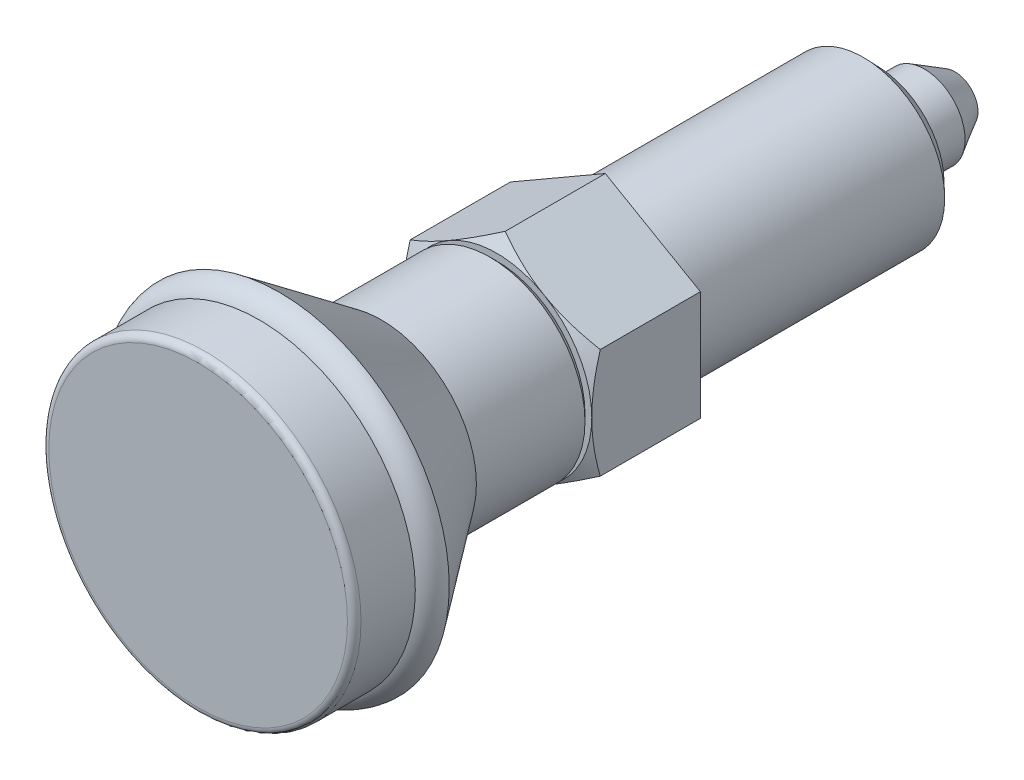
ISO-10303-21;
HEADER;
FILE_DESCRIPTION(('STEP AP214'),'2;1');
FILE_NAME('part.step','',(''),(''),'','','');
FILE_SCHEMA(('AUTOMOTIVE_DESIGN { 1 0 10303 214 1 1 1 1 }'));
ENDSEC;
DATA;
#1=APPLICATION_CONTEXT('core data for automotive mechanical design processes');
#2=APPLICATION_PROTOCOL_DEFINITION('international standard','automotive_design',2000,#1);
#3=PRODUCT_CONTEXT('',#1,'mechanical');
#4=PRODUCT('Part','Part','',(#3));
#5=PRODUCT_RELATED_PRODUCT_CATEGORY('part','',(#4));
#6=PRODUCT_DEFINITION_FORMATION('','',#4);
#7=PRODUCT_DEFINITION_CONTEXT('part definition',#1,'design');
#8=PRODUCT_DEFINITION('design','',#6,#7);
#9=PRODUCT_DEFINITION_SHAPE('','',#8);
#10=(LENGTH_UNIT() NAMED_UNIT(*) SI_UNIT(.MILLI.,.METRE.));
#11=(NAMED_UNIT(*) PLANE_ANGLE_UNIT() SI_UNIT($,.RADIAN.));
#12=(NAMED_UNIT(*) SI_UNIT($,.STERADIAN.) SOLID_ANGLE_UNIT());
#13=UNCERTAINTY_MEASURE_WITH_UNIT(LENGTH_MEASURE(1.E-05),#10,'distance_accuracy_value','');
#14=(GEOMETRIC_REPRESENTATION_CONTEXT(3) GLOBAL_UNCERTAINTY_ASSIGNED_CONTEXT((#13)) GLOBAL_UNIT_ASSIGNED_CONTEXT((#10,
#11,#12)) REPRESENTATION_CONTEXT('',''));
#15=CARTESIAN_POINT('',(0.,0.,0.));
#16=DIRECTION('',(0.,0.,1.));
#17=DIRECTION('',(1.,0.,0.));
#18=AXIS2_PLACEMENT_3D('',#15,#16,#17);
#19=CARTESIAN_POINT('',(1.25822981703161E-10,-7.26417500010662E-11,7.99999999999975));
#20=DIRECTION('',(-1.57278727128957E-11,9.08021875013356E-12,-1.));
#21=DIRECTION('',(-1.,0.,1.57278727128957E-11));
#22=AXIS2_PLACEMENT_3D('',#19,#20,#21);
#23=CONICAL_SURFACE('',#22,6.99999999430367,1.04719755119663);
#24=CARTESIAN_POINT('',(7.00020000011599,4.04133641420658,7.3747185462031));
#25=CARTESIAN_POINT('',(6.8463320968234,4.13017208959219,7.42600014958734));
#26=CARTESIAN_POINT('',(6.69189049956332,4.21933898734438,7.47495440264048));
#27=CARTESIAN_POINT('',(6.38175307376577,4.39839691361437,7.56756720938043));
#28=CARTESIAN_POINT('',(6.2260567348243,4.48828823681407,7.61122347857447));
#29=CARTESIAN_POINT('',(5.75647483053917,4.75940147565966,7.73338840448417));
#30=CARTESIAN_POINT('',(5.44073566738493,4.94169356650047,7.80287443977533));
#31=CARTESIAN_POINT('',(4.96823775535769,5.21449036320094,7.88435504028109));
#32=CARTESIAN_POINT('',(4.8128907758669,5.30417998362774,7.90756651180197));
#33=CARTESIAN_POINT('',(4.50149488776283,5.48396448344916,7.94648878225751));
#34=CARTESIAN_POINT('',(4.34544604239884,5.5740593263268,7.96220024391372));
#35=CARTESIAN_POINT('',(4.03307733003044,5.7544054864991,7.98572208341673));
#36=CARTESIAN_POINT('',(3.87675797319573,5.84465650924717,7.9935414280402));
#37=CARTESIAN_POINT('',(3.56398349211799,6.02523694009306,8.00111975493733));
#38=CARTESIAN_POINT('',(3.40752837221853,6.11556634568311,8.00087898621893));
#39=CARTESIAN_POINT('',(2.97889312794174,6.36303901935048,7.98914026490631));
#40=CARTESIAN_POINT('',(2.70685331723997,6.52010127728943,7.9694342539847));
#41=CARTESIAN_POINT('',(2.16458056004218,6.83318259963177,7.90694653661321));
#42=CARTESIAN_POINT('',(1.89434952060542,6.98920056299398,7.86414347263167));
#43=CARTESIAN_POINT('',(1.35098545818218,7.30291195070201,7.75714831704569));
#44=CARTESIAN_POINT('',(1.07792099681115,7.46056579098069,7.69250290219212));
#45=CARTESIAN_POINT('',(0.535864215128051,7.77352241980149,7.54578392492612));
#46=CARTESIAN_POINT('',(0.266864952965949,7.92882921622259,7.46374482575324));
#47=CARTESIAN_POINT('',(-0.000199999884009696,8.08301923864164,7.3747185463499));
#48=B_SPLINE_CURVE_WITH_KNOTS('',3,(#24,#25,#26,#27,#28,#29,#30,#31,#32,#33,#34,#35,#36,#37,#38,
#39,#40,#41,#42,#43,#44,#45,#46,#47),.UNSPECIFIED.,.F.,.F.,(4,2,2,2,2,2,2,2,2,2,2,4),(0.,
0.55472791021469,1.10969417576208,2.22193274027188,2.76443041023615,3.30688013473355,
3.84871284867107,4.39052882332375,5.33376515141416,6.27787517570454,7.24292418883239,
8.20607866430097),.UNSPECIFIED.);
#49=CARTESIAN_POINT('',(3.50000000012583,6.06217782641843,7.99999999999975));
#50=VERTEX_POINT('',#49);
#51=CARTESIAN_POINT('',(0.,8.08290376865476,7.37478521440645));
#52=VERTEX_POINT('',#51);
#53=EDGE_CURVE('E103',#50,#52,#48,.T.);
#54=ORIENTED_EDGE('',*,*,#53,.T.);
#55=CARTESIAN_POINT('',(0.000200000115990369,8.08301923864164,7.37471854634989));
#56=CARTESIAN_POINT('',(-0.153667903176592,7.99418356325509,7.42600014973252));
#57=CARTESIAN_POINT('',(-0.30810950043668,7.90501666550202,7.47495440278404));
#58=CARTESIAN_POINT('',(-0.618246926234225,7.72595873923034,7.56756720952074));
#59=CARTESIAN_POINT('',(-0.773943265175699,7.63606741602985,7.61122347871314));
#60=CARTESIAN_POINT('',(-1.24352516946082,7.36495417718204,7.73338840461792));
#61=CARTESIAN_POINT('',(-1.55926433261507,7.18266208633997,7.80287443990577));
#62=CARTESIAN_POINT('',(-2.03176224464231,6.90986528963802,7.88435504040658));
#63=CARTESIAN_POINT('',(-2.1871092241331,6.8201756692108,7.90756651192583));
#64=CARTESIAN_POINT('',(-2.49850511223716,6.64039116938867,7.9464887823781));
#65=CARTESIAN_POINT('',(-2.65455395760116,6.55029632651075,7.96220024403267));
#66=CARTESIAN_POINT('',(-2.96692266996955,6.36995016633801,7.98572208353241));
#67=CARTESIAN_POINT('',(-3.12324202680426,6.2796991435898,7.99354142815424));
#68=CARTESIAN_POINT('',(-3.43601650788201,6.09911871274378,8.00111975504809));
#69=CARTESIAN_POINT('',(-3.59247162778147,6.00878930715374,8.00087898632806));
#70=CARTESIAN_POINT('',(-4.02110687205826,5.76131663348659,7.98914026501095));
#71=CARTESIAN_POINT('',(-4.29314668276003,5.60425437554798,7.96943425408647));
#72=CARTESIAN_POINT('',(-4.83541943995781,5.29117305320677,7.9069465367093));
#73=CARTESIAN_POINT('',(-5.10565047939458,5.13515508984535,7.86414347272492));
#74=CARTESIAN_POINT('',(-5.64901454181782,4.82144370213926,7.75714831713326));
#75=CARTESIAN_POINT('',(-5.92207900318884,4.66378986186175,7.69250290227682));
#76=CARTESIAN_POINT('',(-6.46413578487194,4.35083323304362,7.54578392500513));
#77=CARTESIAN_POINT('',(-6.73313504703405,4.19552643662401,7.46374482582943));
#78=CARTESIAN_POINT('',(-7.00019999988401,4.04133641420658,7.37471854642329));
#79=B_SPLINE_CURVE_WITH_KNOTS('',3,(#55,#56,#57,#58,#59,#60,#61,#62,#63,#64,#65,#66,#67,#68,#69,
#70,#71,#72,#73,#74,#75,#76,#77,#78),.UNSPECIFIED.,.F.,.F.,(4,2,2,2,2,2,2,2,2,2,2,4),(0.,
0.55472791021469,1.10969417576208,2.22193274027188,2.76443041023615,3.30688013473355,
3.84871284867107,4.39052882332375,5.33376515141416,6.27787517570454,7.24292418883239,
8.20607866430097),.UNSPECIFIED.);
#80=CARTESIAN_POINT('',(-3.49999999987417,6.06217782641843,8.00000000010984));
#81=VERTEX_POINT('',#80);
#82=EDGE_CURVE('E93',#52,#81,#79,.T.);
#83=ORIENTED_EDGE('',*,*,#82,.T.);
#84=CARTESIAN_POINT('',(1.25822981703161E-10,-7.26417500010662E-11,7.99999999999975));
#85=DIRECTION('',(1.57278727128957E-11,-9.08021875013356E-12,1.));
#86=DIRECTION('',(1.,0.,-1.57278727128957E-11));
#87=AXIS2_PLACEMENT_3D('',#84,#85,#86);
#88=CIRCLE('',#87,6.99999999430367);
#89=EDGE_CURVE('E266',#50,#81,#88,.T.);
#90=ORIENTED_EDGE('',*,*,#89,.F.);
#91=EDGE_LOOP('',(#54,#83,#90));
#92=FACE_BOUND('',#91,.T.);
#93=ADVANCED_FACE('F15',(#92),#23,.T.);
#94=CARTESIAN_POINT('',(-6.99999999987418,-7.26417500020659E-11,8.00000000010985));
#95=VERTEX_POINT('',#94);
#96=EDGE_CURVE('E274',#81,#95,#88,.T.);
#97=ORIENTED_EDGE('',*,*,#96,.F.);
#98=CARTESIAN_POINT('',(-6.99999999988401,4.04145188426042,7.37478521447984));
#99=VERTEX_POINT('',#98);
#100=EDGE_CURVE('E191',#81,#99,#79,.T.);
#101=ORIENTED_EDGE('',*,*,#100,.T.);
#102=CARTESIAN_POINT('',(-6.99999999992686,-10.7185259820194,4.65031305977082));
#103=CARTESIAN_POINT('',(-6.99999999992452,-10.4111863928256,4.79883652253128));
#104=CARTESIAN_POINT('',(-6.99999999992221,-10.1031201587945,4.9458835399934));
#105=CARTESIAN_POINT('',(-6.99999999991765,-9.48514148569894,5.23618099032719));
#106=CARTESIAN_POINT('',(-6.99999999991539,-9.17522873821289,5.37943076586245));
#107=CARTESIAN_POINT('',(-6.99999999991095,-8.55148999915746,5.66204468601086));
#108=CARTESIAN_POINT('',(-6.99999999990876,-8.23765176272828,5.80138190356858));
#109=CARTESIAN_POINT('',(-6.99999999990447,-7.60739587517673,6.07407147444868));
#110=CARTESIAN_POINT('',(-6.99999999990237,-7.29097835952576,6.20742413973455));
#111=CARTESIAN_POINT('',(-6.99999999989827,-6.65113230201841,6.46813635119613));
#112=CARTESIAN_POINT('',(-6.99999999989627,-6.32766537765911,6.59540222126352));
#113=CARTESIAN_POINT('',(-6.99999999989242,-5.67691706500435,6.83996662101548));
#114=CARTESIAN_POINT('',(-6.99999999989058,-5.34963525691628,6.9572640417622));
#115=CARTESIAN_POINT('',(-6.99999999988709,-4.69140465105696,7.17873933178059));
#116=CARTESIAN_POINT('',(-6.99999999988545,-4.36046534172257,7.2829450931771));
#117=CARTESIAN_POINT('',(-6.99999999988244,-3.69389387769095,7.47485451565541));
#118=CARTESIAN_POINT('',(-6.99999999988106,-3.35826324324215,7.5625633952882));
#119=CARTESIAN_POINT('',(-6.99999999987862,-2.68202380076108,7.71721463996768));
#120=CARTESIAN_POINT('',(-6.99999999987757,-2.34141369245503,7.78415147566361));
#121=CARTESIAN_POINT('',(-6.99999999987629,-1.82750129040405,7.8656261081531));
#122=CARTESIAN_POINT('',(-6.99999999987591,-1.65567653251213,7.88963098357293));
#123=CARTESIAN_POINT('',(-6.99999999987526,-1.311221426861,7.9308582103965));
#124=CARTESIAN_POINT('',(-6.99999999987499,-1.1385911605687,7.94808123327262));
#125=CARTESIAN_POINT('',(-6.99999999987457,-0.79385348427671,7.97528126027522));
#126=CARTESIAN_POINT('',(-6.99999999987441,-0.621749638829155,7.98530325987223));
#127=CARTESIAN_POINT('',(-6.99999999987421,-0.277271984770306,7.99804825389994));
#128=CARTESIAN_POINT('',(-6.99999999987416,-0.104898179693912,8.00077134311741));
#129=CARTESIAN_POINT('',(-6.99999999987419,0.239760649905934,7.99885363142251));
#130=CARTESIAN_POINT('',(-6.99999999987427,0.412045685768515,7.99421489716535));
#131=CARTESIAN_POINT('',(-6.99999999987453,0.756270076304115,7.97768889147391));
#132=CARTESIAN_POINT('',(-6.99999999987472,0.928209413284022,7.965801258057));
#133=CARTESIAN_POINT('',(-6.99999999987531,1.34493742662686,7.9284525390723));
#134=CARTESIAN_POINT('',(-6.99999999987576,1.58940592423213,7.89935949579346));
#135=CARTESIAN_POINT('',(-6.99999999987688,2.07646957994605,7.82813397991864));
#136=CARTESIAN_POINT('',(-6.99999999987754,2.31906420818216,7.78599794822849));
#137=CARTESIAN_POINT('',(-6.99999999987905,2.80217998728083,7.69018088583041));
#138=CARTESIAN_POINT('',(-6.99999999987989,3.04269895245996,7.63648893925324));
#139=CARTESIAN_POINT('',(-6.99999999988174,3.5212622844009,7.51919825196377));
#140=CARTESIAN_POINT('',(-6.99999999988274,3.75930688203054,7.45560044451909));
#141=CARTESIAN_POINT('',(-6.9999999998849,4.23878446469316,7.31835710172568));
#142=CARTESIAN_POINT('',(-6.99999999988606,4.48015747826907,7.24450348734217));
#143=CARTESIAN_POINT('',(-6.9999999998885,4.96035218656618,7.08949909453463));
#144=CARTESIAN_POINT('',(-6.99999999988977,5.19917551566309,7.00835334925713));
#145=CARTESIAN_POINT('',(-6.99999999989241,5.67331254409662,6.84044083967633));
#146=CARTESIAN_POINT('',(-6.99999999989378,5.90863843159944,6.75370828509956));
#147=CARTESIAN_POINT('',(-6.99999999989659,6.37746440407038,6.57515246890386));
#148=CARTESIAN_POINT('',(-6.99999999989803,6.61096370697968,6.48332714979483));
#149=CARTESIAN_POINT('',(-6.99999999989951,6.84361473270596,6.38945923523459));
#150=B_SPLINE_CURVE_WITH_KNOTS('',3,(#102,#103,#104,#105,#106,#107,#108,#109,#110,#111,#112,
#113,#114,#115,#116,#117,#118,#119,#120,#121,#122,#123,#124,#125,#126,#127,#128,#129,#130,#131,
#132,#133,#134,#135,#136,#137,#138,#139,#140,#141,#142,#143,#144,#145,#146,#147,#148,#149),
.UNSPECIFIED.,.F.,.F.,(4,2,2,2,2,2,2,2,2,2,2,2,2,2,2,2,2,2,2,2,2,2,2,4),(0.,1.02405063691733,
2.04827740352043,3.07836540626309,4.10839964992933,5.15107951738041,6.19387522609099,
7.23441013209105,8.27461532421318,9.31509717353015,9.83546471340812,10.3557807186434,
10.8728165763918,11.3898457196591,11.9067297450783,12.4236395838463,13.161808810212,
13.900179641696,14.6392510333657,15.3782528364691,16.1353691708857,16.8919668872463,
17.6443059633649,18.3969512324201),.UNSPECIFIED.);
#151=EDGE_CURVE('E190',#99,#95,#150,.F.);
#152=ORIENTED_EDGE('',*,*,#151,.T.);
#153=EDGE_LOOP('',(#97,#101,#152));
#154=FACE_BOUND('',#153,.T.);
#155=ADVANCED_FACE('F233',(#154),#23,.T.);
#156=CARTESIAN_POINT('',(-3.49999999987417,-6.06217782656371,7.99999999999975));
#157=VERTEX_POINT('',#156);
#158=EDGE_CURVE('E283',#95,#157,#88,.T.);
#159=ORIENTED_EDGE('',*,*,#158,.F.);
#160=CARTESIAN_POINT('',(-6.99999999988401,-4.04145188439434,7.37478521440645));
#161=VERTEX_POINT('',#160);
#162=EDGE_CURVE('E182',#95,#161,#150,.F.);
#163=ORIENTED_EDGE('',*,*,#162,.T.);
#164=CARTESIAN_POINT('',(-7.00019999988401,-4.04133641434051,7.3747185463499));
#165=CARTESIAN_POINT('',(-6.84633209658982,-4.13017208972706,7.42600014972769));
#166=CARTESIAN_POINT('',(-6.69189049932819,-4.21933898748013,7.47495440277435));
#167=CARTESIAN_POINT('',(-6.38175307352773,-4.39839691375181,7.56756720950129));
#168=CARTESIAN_POINT('',(-6.22605673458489,-4.4882882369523,7.6112234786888));
#169=CARTESIAN_POINT('',(-5.75647483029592,-4.75940147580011,7.73338840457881));
#170=CARTESIAN_POINT('',(-5.44073566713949,-4.94169356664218,7.80287443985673));
#171=CARTESIAN_POINT('',(-4.96823775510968,-5.21449036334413,7.88435504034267));
#172=CARTESIAN_POINT('',(-4.81289077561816,-5.30417998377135,7.90756651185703));
#173=CARTESIAN_POINT('',(-4.50149488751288,-5.48396448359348,7.94648878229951));
#174=CARTESIAN_POINT('',(-4.34544604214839,-5.5740593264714,7.96220024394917));
#175=CARTESIAN_POINT('',(-4.03307732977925,-5.75440548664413,7.98572208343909));
#176=CARTESIAN_POINT('',(-3.8767579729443,-5.84465650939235,7.993541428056));
#177=CARTESIAN_POINT('',(-3.56398349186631,-6.02523694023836,8.00111975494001));
#178=CARTESIAN_POINT('',(-3.40752837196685,-6.1155663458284,8.00087898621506));
#179=CARTESIAN_POINT('',(-2.97889312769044,-6.36303901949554,7.98914026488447));
#180=CARTESIAN_POINT('',(-2.70685331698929,-6.52010127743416,7.96943425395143));
#181=CARTESIAN_POINT('',(-2.16458055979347,-6.83318259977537,7.9069465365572));
#182=CARTESIAN_POINT('',(-1.89434952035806,-6.9892005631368,7.86414347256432));
#183=CARTESIAN_POINT('',(-1.35098545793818,-7.30291195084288,7.75714831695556));
#184=CARTESIAN_POINT('',(-1.07792099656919,-7.46056579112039,7.69250290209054));
#185=CARTESIAN_POINT('',(-0.535864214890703,-7.77352241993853,7.5457839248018));
#186=CARTESIAN_POINT('',(-0.26686495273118,-7.92882921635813,7.46374482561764));
#187=CARTESIAN_POINT('',(0.000200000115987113,-8.08301923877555,7.3747185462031));
#188=B_SPLINE_CURVE_WITH_KNOTS('',3,(#164,#165,#166,#167,#168,#169,#170,#171,#172,#173,#174,
#175,#176,#177,#178,#179,#180,#181,#182,#183,#184,#185,#186,#187),.UNSPECIFIED.,.F.,.F.,(4,2,2,
2,2,2,2,2,2,2,2,4),(0.,0.554727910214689,1.10969417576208,2.22193274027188,2.76443041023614,
3.30688013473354,3.84871284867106,4.39052882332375,5.33376515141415,6.27787517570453,
7.24292418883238,8.20607866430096),.UNSPECIFIED.);
#189=EDGE_CURVE('E181',#161,#157,#188,.T.);
#190=ORIENTED_EDGE('',*,*,#189,.T.);
#191=EDGE_LOOP('',(#159,#163,#190));
#192=FACE_BOUND('',#191,.T.);
#193=ADVANCED_FACE('F240',(#192),#23,.T.);
#194=CARTESIAN_POINT('',(3.50000000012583,-6.06217782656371,7.99999999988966));
#195=VERTEX_POINT('',#194);
#196=EDGE_CURVE('E277',#157,#195,#88,.T.);
#197=ORIENTED_EDGE('',*,*,#196,.F.);
#198=CARTESIAN_POINT('',(1.15987839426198E-10,-8.08290376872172,7.37478521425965));
#199=VERTEX_POINT('',#198);
#200=EDGE_CURVE('E173',#157,#199,#188,.T.);
#201=ORIENTED_EDGE('',*,*,#200,.T.);
#202=CARTESIAN_POINT('',(-0.000199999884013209,-8.08301923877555,7.37471854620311));
#203=CARTESIAN_POINT('',(0.153667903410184,-7.99418356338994,7.42600014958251));
#204=CARTESIAN_POINT('',(0.308109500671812,-7.90501666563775,7.47495440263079));
#205=CARTESIAN_POINT('',(0.61824692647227,-7.72595873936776,7.56756720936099));
#206=CARTESIAN_POINT('',(0.773943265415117,-7.63606741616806,7.61122347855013));
#207=CARTESIAN_POINT('',(1.24352516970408,-7.36495417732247,7.73338840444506));
#208=CARTESIAN_POINT('',(1.55926433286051,-7.18266208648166,7.80287443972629));
#209=CARTESIAN_POINT('',(2.03176224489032,-6.9098652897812,7.88435504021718));
#210=CARTESIAN_POINT('',(2.18710922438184,-6.82017566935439,7.90756651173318));
#211=CARTESIAN_POINT('',(2.49850511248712,-6.64039116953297,7.94648878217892));
#212=CARTESIAN_POINT('',(2.65455395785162,-6.55029632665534,7.96220024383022));
#213=CARTESIAN_POINT('',(2.96692267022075,-6.36995016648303,7.98572208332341));
#214=CARTESIAN_POINT('',(3.12324202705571,-6.27969914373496,7.99354142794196));
#215=CARTESIAN_POINT('',(3.43601650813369,-6.09911871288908,8.00111975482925));
#216=CARTESIAN_POINT('',(3.59247162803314,-6.00878930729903,8.00087898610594));
#217=CARTESIAN_POINT('',(4.02110687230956,-5.76131663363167,7.98914026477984));
#218=CARTESIAN_POINT('',(4.29314668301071,-5.6042543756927,7.96943425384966));
#219=CARTESIAN_POINT('',(4.83541944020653,-5.29117305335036,7.90694653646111));
#220=CARTESIAN_POINT('',(5.10565047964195,-5.13515508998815,7.86414347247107));
#221=CARTESIAN_POINT('',(5.64901454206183,-4.82144370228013,7.757148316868));
#222=CARTESIAN_POINT('',(5.92207900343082,-4.66378986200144,7.69250290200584));
#223=CARTESIAN_POINT('',(6.4641357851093,-4.35083323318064,7.54578392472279));
#224=CARTESIAN_POINT('',(6.73313504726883,-4.19552643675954,7.46374482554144));
#225=CARTESIAN_POINT('',(7.00020000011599,-4.04133641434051,7.3747185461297));
#226=B_SPLINE_CURVE_WITH_KNOTS('',3,(#202,#203,#204,#205,#206,#207,#208,#209,#210,#211,#212,
#213,#214,#215,#216,#217,#218,#219,#220,#221,#222,#223,#224,#225),.UNSPECIFIED.,.F.,.F.,(4,2,2,
2,2,2,2,2,2,2,2,4),(0.,0.554727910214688,1.10969417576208,2.22193274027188,2.76443041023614,
3.30688013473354,3.84871284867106,4.39052882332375,5.33376515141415,6.27787517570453,
7.24292418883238,8.20607866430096),.UNSPECIFIED.);
#227=EDGE_CURVE('E171',#199,#195,#226,.T.);
#228=ORIENTED_EDGE('',*,*,#227,.T.);
#229=EDGE_LOOP('',(#197,#201,#228));
#230=FACE_BOUND('',#229,.T.);
#231=ADVANCED_FACE('F253',(#230),#23,.T.);
#232=CARTESIAN_POINT('',(7.00000000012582,-7.26417500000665E-11,7.99999999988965));
#233=VERTEX_POINT('',#232);
#234=EDGE_CURVE('E268',#195,#233,#88,.T.);
#235=ORIENTED_EDGE('',*,*,#234,.F.);
#236=CARTESIAN_POINT('',(7.00000000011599,-4.04145188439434,7.37478521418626));
#237=VERTEX_POINT('',#236);
#238=EDGE_CURVE('E163',#195,#237,#226,.T.);
#239=ORIENTED_EDGE('',*,*,#238,.T.);
#240=CARTESIAN_POINT('',(7.00000000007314,-10.7185259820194,4.65031305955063));
#241=CARTESIAN_POINT('',(7.00000000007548,-10.4111863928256,4.79883652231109));
#242=CARTESIAN_POINT('',(7.00000000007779,-10.1031201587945,4.94588353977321));
#243=CARTESIAN_POINT('',(7.00000000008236,-9.48514148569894,5.236180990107));
#244=CARTESIAN_POINT('',(7.00000000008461,-9.17522873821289,5.37943076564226));
#245=CARTESIAN_POINT('',(7.00000000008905,-8.55148999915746,5.66204468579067));
#246=CARTESIAN_POINT('',(7.00000000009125,-8.23765176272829,5.80138190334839));
#247=CARTESIAN_POINT('',(7.00000000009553,-7.60739587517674,6.07407147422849));
#248=CARTESIAN_POINT('',(7.00000000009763,-7.29097835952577,6.20742413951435));
#249=CARTESIAN_POINT('',(7.00000000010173,-6.65113230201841,6.46813635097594));
#250=CARTESIAN_POINT('',(7.00000000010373,-6.32766537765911,6.59540222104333));
#251=CARTESIAN_POINT('',(7.00000000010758,-5.67691706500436,6.83996662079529));
#252=CARTESIAN_POINT('',(7.00000000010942,-5.34963525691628,6.95726404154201));
#253=CARTESIAN_POINT('',(7.00000000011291,-4.69140465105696,7.1787393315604));
#254=CARTESIAN_POINT('',(7.00000000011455,-4.36046534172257,7.2829450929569));
#255=CARTESIAN_POINT('',(7.00000000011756,-3.69389387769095,7.47485451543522));
#256=CARTESIAN_POINT('',(7.00000000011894,-3.35826324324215,7.56256339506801));
#257=CARTESIAN_POINT('',(7.00000000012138,-2.68202380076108,7.71721463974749));
#258=CARTESIAN_POINT('',(7.00000000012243,-2.34141369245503,7.78415147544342));
#259=CARTESIAN_POINT('',(7.00000000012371,-1.82750129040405,7.86562610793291));
#260=CARTESIAN_POINT('',(7.00000000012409,-1.65567653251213,7.88963098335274));
#261=CARTESIAN_POINT('',(7.00000000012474,-1.311221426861,7.93085821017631));
#262=CARTESIAN_POINT('',(7.00000000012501,-1.1385911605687,7.94808123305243));
#263=CARTESIAN_POINT('',(7.00000000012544,-0.793853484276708,7.97528126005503));
#264=CARTESIAN_POINT('',(7.00000000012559,-0.621749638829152,7.98530325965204));
#265=CARTESIAN_POINT('',(7.00000000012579,-0.277271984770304,7.99804825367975));
#266=CARTESIAN_POINT('',(7.00000000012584,-0.10489817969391,8.00077134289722));
#267=CARTESIAN_POINT('',(7.00000000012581,0.239760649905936,7.99885363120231));
#268=CARTESIAN_POINT('',(7.00000000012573,0.412045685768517,7.99421489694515));
#269=CARTESIAN_POINT('',(7.00000000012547,0.756270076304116,7.97768889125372));
#270=CARTESIAN_POINT('',(7.00000000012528,0.928209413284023,7.96580125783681));
#271=CARTESIAN_POINT('',(7.00000000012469,1.34493742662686,7.92845253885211));
#272=CARTESIAN_POINT('',(7.00000000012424,1.58940592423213,7.89935949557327));
#273=CARTESIAN_POINT('',(7.00000000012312,2.07646957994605,7.82813397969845));
#274=CARTESIAN_POINT('',(7.00000000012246,2.31906420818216,7.7859979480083));
#275=CARTESIAN_POINT('',(7.00000000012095,2.80217998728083,7.69018088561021));
#276=CARTESIAN_POINT('',(7.00000000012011,3.04269895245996,7.63648893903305));
#277=CARTESIAN_POINT('',(7.00000000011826,3.52126228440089,7.51919825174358));
#278=CARTESIAN_POINT('',(7.00000000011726,3.75930688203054,7.4556004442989));
#279=CARTESIAN_POINT('',(7.0000000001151,4.23878446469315,7.31835710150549));
#280=CARTESIAN_POINT('',(7.00000000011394,4.48015747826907,7.24450348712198));
#281=CARTESIAN_POINT('',(7.0000000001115,4.96035218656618,7.08949909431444));
#282=CARTESIAN_POINT('',(7.00000000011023,5.19917551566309,7.00835334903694));
#283=CARTESIAN_POINT('',(7.00000000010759,5.67331254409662,6.84044083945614));
#284=CARTESIAN_POINT('',(7.00000000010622,5.90863843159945,6.75370828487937));
#285=CARTESIAN_POINT('',(7.00000000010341,6.37746440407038,6.57515246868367));
#286=CARTESIAN_POINT('',(7.00000000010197,6.61096370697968,6.48332714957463));
#287=CARTESIAN_POINT('',(7.00000000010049,6.84361473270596,6.38945923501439));
#288=B_SPLINE_CURVE_WITH_KNOTS('',3,(#240,#241,#242,#243,#244,#245,#246,#247,#248,#249,#250,
#251,#252,#253,#254,#255,#256,#257,#258,#259,#260,#261,#262,#263,#264,#265,#266,#267,#268,#269,
#270,#271,#272,#273,#274,#275,#276,#277,#278,#279,#280,#281,#282,#283,#284,#285,#286,#287),
.UNSPECIFIED.,.F.,.F.,(4,2,2,2,2,2,2,2,2,2,2,2,2,2,2,2,2,2,2,2,2,2,2,4),(0.,1.02405063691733,
2.04827740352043,3.07836540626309,4.10839964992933,5.1510795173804,6.19387522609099,
7.23441013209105,8.27461532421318,9.31509717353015,9.83546471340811,10.3557807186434,
10.8728165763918,11.3898457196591,11.9067297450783,12.4236395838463,13.161808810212,
13.900179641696,14.6392510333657,15.3782528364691,16.1353691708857,16.8919668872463,
17.6443059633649,18.3969512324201),.UNSPECIFIED.);
#289=EDGE_CURVE('E172',#237,#233,#288,.T.);
#290=ORIENTED_EDGE('',*,*,#289,.T.);
#291=EDGE_LOOP('',(#235,#239,#290));
#292=FACE_BOUND('',#291,.T.);
#293=ADVANCED_FACE('F244',(#292),#23,.T.);
#294=EDGE_CURVE('E259',#233,#50,#88,.T.);
#295=ORIENTED_EDGE('',*,*,#294,.F.);
#296=CARTESIAN_POINT('',(7.00000000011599,4.04145188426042,7.37478521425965));
#297=VERTEX_POINT('',#296);
#298=EDGE_CURVE('E139',#233,#297,#288,.T.);
#299=ORIENTED_EDGE('',*,*,#298,.T.);
#300=EDGE_CURVE('E138',#297,#50,#48,.T.);
#301=ORIENTED_EDGE('',*,*,#300,.T.);
#302=EDGE_LOOP('',(#295,#299,#301));
#303=FACE_BOUND('',#302,.T.);
#304=ADVANCED_FACE('F235',(#303),#23,.T.);
#305=CARTESIAN_POINT('',(4.7183618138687E-10,10.9999999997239,30.0000000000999));
#306=DIRECTION('',(1.57278727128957E-11,-9.08021875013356E-12,1.));
#307=DIRECTION('',(1.,0.,-1.57278727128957E-11));
#308=AXIS2_PLACEMENT_3D('',#305,#306,#307);
#309=PLANE('',#308);
#310=CARTESIAN_POINT('',(4.7183618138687E-10,-2.72406562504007E-10,30.));
#311=DIRECTION('',(1.57278727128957E-11,-9.08021875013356E-12,1.));
#312=DIRECTION('',(1.,0.,-1.57278727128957E-11));
#313=AXIS2_PLACEMENT_3D('',#310,#311,#312);
#314=CIRCLE('',#313,10.9999999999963);
#315=CARTESIAN_POINT('',(11.0000000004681,-2.72406562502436E-10,29.999999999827));
#316=VERTEX_POINT('',#315);
#317=EDGE_CURVE('E9',#316,#316,#314,.T.);
#318=ORIENTED_EDGE('',*,*,#317,.T.);
#319=EDGE_LOOP('',(#318));
#320=FACE_BOUND('',#319,.T.);
#321=ADVANCED_FACE('F243',(#320),#309,.T.);
#322=CARTESIAN_POINT('',(4.63972245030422E-10,-2.6786645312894E-10,29.5));
#323=DIRECTION('',(1.57278727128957E-11,-9.08021875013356E-12,1.));
#324=DIRECTION('',(1.,0.,-1.57278727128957E-11));
#325=AXIS2_PLACEMENT_3D('',#322,#323,#324);
#326=TOROIDAL_SURFACE('',#325,10.9999999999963,0.5);
#327=CARTESIAN_POINT('',(4.63972245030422E-10,-2.6786645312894E-10,29.5));
#328=DIRECTION('',(1.57278727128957E-11,-9.08021875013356E-12,1.));
#329=DIRECTION('',(1.,0.,-1.57278727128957E-11));
#330=AXIS2_PLACEMENT_3D('',#327,#328,#329);
#331=CIRCLE('',#330,11.4999999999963);
#332=CARTESIAN_POINT('',(11.5000000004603,-2.67866453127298E-10,29.4999999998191));
#333=VERTEX_POINT('',#332);
#334=EDGE_CURVE('E24',#333,#333,#331,.T.);
#335=ORIENTED_EDGE('',*,*,#334,.T.);
#336=EDGE_LOOP('',(#335));
#337=FACE_BOUND('',#336,.T.);
#338=ORIENTED_EDGE('',*,*,#317,.F.);
#339=EDGE_LOOP('',(#338));
#340=FACE_BOUND('',#339,.T.);
#341=ADVANCED_FACE('F251',(#337,#340),#326,.T.);
#342=CARTESIAN_POINT('',(4.7183618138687E-10,-2.72406562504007E-10,30.));
#343=DIRECTION('',(1.57278727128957E-11,-9.08021875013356E-12,1.));
#344=DIRECTION('',(1.,0.,-1.57278727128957E-11));
#345=AXIS2_PLACEMENT_3D('',#342,#343,#344);
#346=CYLINDRICAL_SURFACE('',#345,11.4999999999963);
#347=CARTESIAN_POINT('',(4.01060754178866E-10,-2.31545578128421E-10,25.5000000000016));
#348=DIRECTION('',(1.57278727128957E-11,-9.08021875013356E-12,1.));
#349=DIRECTION('',(1.,0.,-1.57278727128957E-11));
#350=AXIS2_PLACEMENT_3D('',#347,#348,#349);
#351=CIRCLE('',#350,11.4999999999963);
#352=CARTESIAN_POINT('',(11.5000000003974,-2.31545578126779E-10,25.4999999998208));
#353=VERTEX_POINT('',#352);
#354=EDGE_CURVE('E538',#353,#353,#351,.T.);
#355=ORIENTED_EDGE('',*,*,#354,.T.);
#356=EDGE_LOOP('',(#355));
#357=FACE_BOUND('',#356,.T.);
#358=ORIENTED_EDGE('',*,*,#334,.F.);
#359=EDGE_LOOP('',(#358));
#360=FACE_BOUND('',#359,.T.);
#361=ADVANCED_FACE('F508',(#357,#360),#346,.T.);
#362=CARTESIAN_POINT('',(3.77468945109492E-10,-2.17925250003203E-10,23.9999999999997));
#363=DIRECTION('',(1.57278727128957E-11,-9.08021875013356E-12,1.));
#364=DIRECTION('',(1.,0.,-1.57278727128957E-11));
#365=AXIS2_PLACEMENT_3D('',#362,#363,#364);
#366=TOROIDAL_SURFACE('',#365,10.8749999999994,1.62500000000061);
#367=CARTESIAN_POINT('',(3.77468945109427E-10,-2.17925250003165E-10,23.9999999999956));
#368=DIRECTION('',(1.57278727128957E-11,-9.08021875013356E-12,1.));
#369=DIRECTION('',(1.,0.,-1.57278727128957E-11));
#370=AXIS2_PLACEMENT_3D('',#367,#368,#369);
#371=CIRCLE('',#370,12.5);
#372=CARTESIAN_POINT('',(12.5000000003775,-2.1792525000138E-10,23.999999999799));
#373=VERTEX_POINT('',#372);
#374=EDGE_CURVE('E541',#373,#373,#371,.T.);
#375=ORIENTED_EDGE('',*,*,#374,.T.);
#376=EDGE_LOOP('',(#375));
#377=FACE_BOUND('',#376,.T.);
#378=ORIENTED_EDGE('',*,*,#354,.F.);
#379=EDGE_LOOP('',(#378));
#380=FACE_BOUND('',#379,.T.);
#381=ADVANCED_FACE('F499',(#377,#380),#366,.T.);
#382=CARTESIAN_POINT('',(3.77468945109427E-10,-2.17925250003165E-10,23.9999999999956));
#383=DIRECTION('',(1.57278727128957E-11,-9.08021875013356E-12,1.));
#384=DIRECTION('',(1.,0.,-1.57278727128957E-11));
#385=AXIS2_PLACEMENT_3D('',#382,#383,#384);
#386=CONICAL_SURFACE('',#385,12.5,0.63274883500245);
#387=CARTESIAN_POINT('',(2.59509899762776E-10,-1.49823609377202E-10,16.5));
#388=DIRECTION('',(1.57278727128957E-11,-9.08021875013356E-12,1.));
#389=DIRECTION('',(1.,0.,-1.57278727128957E-11));
#390=AXIS2_PLACEMENT_3D('',#387,#388,#389);
#391=CIRCLE('',#390,7.);
#392=CARTESIAN_POINT('',(7.00000000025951,-1.49823609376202E-10,16.4999999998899));
#393=VERTEX_POINT('',#392);
#394=EDGE_CURVE('E547',#393,#393,#391,.T.);
#395=ORIENTED_EDGE('',*,*,#394,.T.);
#396=EDGE_LOOP('',(#395));
#397=FACE_BOUND('',#396,.T.);
#398=ORIENTED_EDGE('',*,*,#374,.F.);
#399=EDGE_LOOP('',(#398));
#400=FACE_BOUND('',#399,.T.);
#401=ADVANCED_FACE('F490',(#397,#400),#386,.T.);
#402=CARTESIAN_POINT('',(4.7183618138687E-10,-2.72406562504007E-10,30.));
#403=DIRECTION('',(1.57278727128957E-11,-9.08021875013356E-12,1.));
#404=DIRECTION('',(1.,0.,-1.57278727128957E-11));
#405=AXIS2_PLACEMENT_3D('',#402,#403,#404);
#406=CYLINDRICAL_SURFACE('',#405,7.);
#407=CARTESIAN_POINT('',(1.33686918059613E-10,-7.71818593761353E-11,8.5));
#408=DIRECTION('',(1.57278727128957E-11,-9.08021875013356E-12,1.));
#409=DIRECTION('',(1.,0.,-1.57278727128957E-11));
#410=AXIS2_PLACEMENT_3D('',#407,#408,#409);
#411=CIRCLE('',#410,7.);
#412=CARTESIAN_POINT('',(7.00000000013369,-7.71818593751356E-11,8.4999999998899));
#413=VERTEX_POINT('',#412);
#414=EDGE_CURVE('E272',#413,#413,#411,.T.);
#415=ORIENTED_EDGE('',*,*,#414,.T.);
#416=EDGE_LOOP('',(#415));
#417=FACE_BOUND('',#416,.T.);
#418=ORIENTED_EDGE('',*,*,#394,.F.);
#419=EDGE_LOOP('',(#418));
#420=FACE_BOUND('',#419,.T.);
#421=ADVANCED_FACE('F481',(#417,#420),#406,.T.);
#422=CARTESIAN_POINT('',(1.33686918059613E-10,-7.71818593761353E-11,8.5));
#423=DIRECTION('',(1.57278727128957E-11,-9.08021875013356E-12,1.));
#424=DIRECTION('',(1.,0.,-1.57278727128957E-11));
#425=AXIS2_PLACEMENT_3D('',#422,#423,#424);
#426=CONICAL_SURFACE('',#425,7.,0.785398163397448);
#427=CARTESIAN_POINT('',(1.25822981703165E-10,-7.26417500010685E-11,8.));
#428=DIRECTION('',(1.57278727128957E-11,-9.08021875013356E-12,1.));
#429=DIRECTION('',(1.,0.,-1.57278727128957E-11));
#430=AXIS2_PLACEMENT_3D('',#427,#428,#429);
#431=CIRCLE('',#430,6.5);
#432=CARTESIAN_POINT('',(6.50000000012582,-7.26417500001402E-11,7.99999999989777));
#433=VERTEX_POINT('',#432);
#434=EDGE_CURVE('E265',#433,#433,#431,.T.);
#435=ORIENTED_EDGE('',*,*,#434,.T.);
#436=EDGE_LOOP('',(#435));
#437=FACE_BOUND('',#436,.T.);
#438=ORIENTED_EDGE('',*,*,#414,.F.);
#439=EDGE_LOOP('',(#438));
#440=FACE_BOUND('',#439,.T.);
#441=ADVANCED_FACE('F475',(#437,#440),#426,.T.);
#442=CARTESIAN_POINT('',(1.25822981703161E-10,6.99999999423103,8.00000000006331));
#443=DIRECTION('',(1.57278727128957E-11,-9.08021875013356E-12,1.));
#444=DIRECTION('',(1.,0.,-1.57278727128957E-11));
#445=AXIS2_PLACEMENT_3D('',#442,#443,#444);
#446=PLANE('',#445);
#447=ORIENTED_EDGE('',*,*,#294,.T.);
#448=ORIENTED_EDGE('',*,*,#89,.T.);
#449=ORIENTED_EDGE('',*,*,#96,.T.);
#450=ORIENTED_EDGE('',*,*,#158,.T.);
#451=ORIENTED_EDGE('',*,*,#196,.T.);
#452=ORIENTED_EDGE('',*,*,#234,.T.);
#453=EDGE_LOOP('',(#447,#448,#449,#450,#451,#452));
#454=FACE_BOUND('',#453,.T.);
#455=ORIENTED_EDGE('',*,*,#434,.F.);
#456=EDGE_LOOP('',(#455));
#457=FACE_BOUND('',#456,.T.);
#458=ADVANCED_FACE('F205',(#454,#457),#446,.T.);
#459=CARTESIAN_POINT('',(-6.99999999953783,4.04145188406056,29.3853532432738));
#460=DIRECTION('',(-0.5,0.866025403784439,1.57276364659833E-11));
#461=DIRECTION('',(-0.866025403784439,-0.5,9.08062794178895E-12));
#462=AXIS2_PLACEMENT_3D('',#459,#460,#461);
#463=PLANE('',#462);
#464=DIRECTION('',(-1.57278727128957E-11,9.08021875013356E-12,-1.));
#465=VECTOR('',#464,1.);
#466=CARTESIAN_POINT('',(4.62170830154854E-10,8.08290376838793,29.3853532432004));
#467=LINE('',#466,#465);
#468=CARTESIAN_POINT('',(0.,8.08290376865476,7.33961502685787E-11));
#469=VERTEX_POINT('',#468);
#470=EDGE_CURVE('E31',#52,#469,#467,.T.);
#471=ORIENTED_EDGE('',*,*,#470,.T.);
#472=DIRECTION('',(0.866025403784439,0.5,-9.08062794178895E-12));
#473=VECTOR('',#472,1.);
#474=CARTESIAN_POINT('',(-7.,4.04145188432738,1.46792300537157E-10));
#475=LINE('',#474,#473);
#476=CARTESIAN_POINT('',(-7.,4.04145188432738,1.46792300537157E-10));
#477=VERTEX_POINT('',#476);
#478=EDGE_CURVE('E90',#477,#469,#475,.T.);
#479=ORIENTED_EDGE('',*,*,#478,.F.);
#480=DIRECTION('',(-1.57278727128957E-11,9.08021875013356E-12,-1.));
#481=VECTOR('',#480,1.);
#482=CARTESIAN_POINT('',(-6.99999999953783,4.04145188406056,29.3853532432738));
#483=LINE('',#482,#481);
#484=EDGE_CURVE('E111',#99,#477,#483,.T.);
#485=ORIENTED_EDGE('',*,*,#484,.F.);
#486=ORIENTED_EDGE('',*,*,#100,.F.);
#487=ORIENTED_EDGE('',*,*,#82,.F.);
#488=EDGE_LOOP('',(#471,#479,#485,#486,#487));
#489=FACE_BOUND('',#488,.T.);
#490=ADVANCED_FACE('F87',(#489),#463,.T.);
#491=CARTESIAN_POINT('',(-6.99999999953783,-4.0414518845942,29.3853532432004));
#492=DIRECTION('',(-1.,0.,1.57278727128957E-11));
#493=DIRECTION('',(1.57278727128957E-11,-9.08021875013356E-12,1.));
#494=AXIS2_PLACEMENT_3D('',#491,#492,#493);
#495=PLANE('',#494);
#496=ORIENTED_EDGE('',*,*,#484,.T.);
#497=DIRECTION('',(0.,1.,9.08021875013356E-12));
#498=VECTOR('',#497,1.);
#499=CARTESIAN_POINT('',(-7.,-4.04145188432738,7.33961502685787E-11));
#500=LINE('',#499,#498);
#501=CARTESIAN_POINT('',(-7.,-4.04145188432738,7.33961502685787E-11));
#502=VERTEX_POINT('',#501);
#503=EDGE_CURVE('E108',#502,#477,#500,.T.);
#504=ORIENTED_EDGE('',*,*,#503,.F.);
#505=DIRECTION('',(-1.57278727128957E-11,9.08021875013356E-12,-1.));
#506=VECTOR('',#505,1.);
#507=CARTESIAN_POINT('',(-6.99999999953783,-4.0414518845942,29.3853532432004));
#508=LINE('',#507,#506);
#509=EDGE_CURVE('E110',#161,#502,#508,.T.);
#510=ORIENTED_EDGE('',*,*,#509,.F.);
#511=ORIENTED_EDGE('',*,*,#162,.F.);
#512=ORIENTED_EDGE('',*,*,#151,.F.);
#513=EDGE_LOOP('',(#496,#504,#510,#511,#512));
#514=FACE_BOUND('',#513,.T.);
#515=ADVANCED_FACE('F198',(#514),#495,.T.);
#516=CARTESIAN_POINT('',(4.621672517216E-10,-8.08290376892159,29.3853532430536));
#517=DIRECTION('',(-0.5,-0.866025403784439,0.));
#518=DIRECTION('',(0.866025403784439,-0.5,-1.81608466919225E-11));
#519=AXIS2_PLACEMENT_3D('',#516,#517,#518);
#520=PLANE('',#519);
#521=ORIENTED_EDGE('',*,*,#509,.T.);
#522=DIRECTION('',(-0.866025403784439,0.5,1.81608466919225E-11));
#523=VECTOR('',#522,1.);
#524=CARTESIAN_POINT('',(0.,-8.08290376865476,-7.33961502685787E-11));
#525=LINE('',#524,#523);
#526=CARTESIAN_POINT('',(0.,-8.08290376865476,-7.33961502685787E-11));
#527=VERTEX_POINT('',#526);
#528=EDGE_CURVE('E123',#527,#502,#525,.T.);
#529=ORIENTED_EDGE('',*,*,#528,.F.);
#530=DIRECTION('',(-1.57278727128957E-11,9.08021875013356E-12,-1.));
#531=VECTOR('',#530,1.);
#532=CARTESIAN_POINT('',(4.621672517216E-10,-8.08290376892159,29.3853532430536));
#533=LINE('',#532,#531);
#534=EDGE_CURVE('E120',#199,#527,#533,.T.);
#535=ORIENTED_EDGE('',*,*,#534,.F.);
#536=ORIENTED_EDGE('',*,*,#200,.F.);
#537=ORIENTED_EDGE('',*,*,#189,.F.);
#538=EDGE_LOOP('',(#521,#529,#535,#536,#537));
#539=FACE_BOUND('',#538,.T.);
#540=ADVANCED_FACE('F159',(#539),#520,.T.);
#541=CARTESIAN_POINT('',(7.00000000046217,-4.0414518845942,29.3853532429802));
#542=DIRECTION('',(0.5,-0.866025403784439,-1.57276364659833E-11));
#543=DIRECTION('',(0.866025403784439,0.5,-9.08062794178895E-12));
#544=AXIS2_PLACEMENT_3D('',#541,#542,#543);
#545=PLANE('',#544);
#546=ORIENTED_EDGE('',*,*,#534,.T.);
#547=DIRECTION('',(-0.866025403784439,-0.5,9.08062794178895E-12));
#548=VECTOR('',#547,1.);
#549=CARTESIAN_POINT('',(7.,-4.04145188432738,-1.46792300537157E-10));
#550=LINE('',#549,#548);
#551=CARTESIAN_POINT('',(7.,-4.04145188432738,-1.46792300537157E-10));
#552=VERTEX_POINT('',#551);
#553=EDGE_CURVE('E127',#552,#527,#550,.T.);
#554=ORIENTED_EDGE('',*,*,#553,.F.);
#555=DIRECTION('',(-1.57278727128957E-11,9.08021875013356E-12,-1.));
#556=VECTOR('',#555,1.);
#557=CARTESIAN_POINT('',(7.00000000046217,-4.0414518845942,29.3853532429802));
#558=LINE('',#557,#556);
#559=EDGE_CURVE('E124',#237,#552,#558,.T.);
#560=ORIENTED_EDGE('',*,*,#559,.F.);
#561=ORIENTED_EDGE('',*,*,#238,.F.);
#562=ORIENTED_EDGE('',*,*,#227,.F.);
#563=EDGE_LOOP('',(#546,#554,#560,#561,#562));
#564=FACE_BOUND('',#563,.T.);
#565=ADVANCED_FACE('F155',(#564),#545,.T.);
#566=CARTESIAN_POINT('',(7.00000000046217,4.04145188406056,29.3853532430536));
#567=DIRECTION('',(1.,0.,-1.57278727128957E-11));
#568=DIRECTION('',(-1.57278727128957E-11,9.08021875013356E-12,-1.));
#569=AXIS2_PLACEMENT_3D('',#566,#567,#568);
#570=PLANE('',#569);
#571=ORIENTED_EDGE('',*,*,#559,.T.);
#572=DIRECTION('',(0.,-1.,-9.08021875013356E-12));
#573=VECTOR('',#572,1.);
#574=CARTESIAN_POINT('',(7.,4.04145188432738,-7.33961502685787E-11));
#575=LINE('',#574,#573);
#576=CARTESIAN_POINT('',(7.00000000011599,4.04145188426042,-7.33961502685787E-11));
#577=VERTEX_POINT('',#576);
#578=EDGE_CURVE('E39',#577,#552,#575,.T.);
#579=ORIENTED_EDGE('',*,*,#578,.F.);
#580=DIRECTION('',(-1.57278727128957E-11,9.08021875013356E-12,-1.));
#581=VECTOR('',#580,1.);
#582=CARTESIAN_POINT('',(7.00000000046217,4.04145188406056,29.3853532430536));
#583=LINE('',#582,#581);
#584=EDGE_CURVE('E100',#297,#577,#583,.T.);
#585=ORIENTED_EDGE('',*,*,#584,.F.);
#586=ORIENTED_EDGE('',*,*,#298,.F.);
#587=ORIENTED_EDGE('',*,*,#289,.F.);
#588=EDGE_LOOP('',(#571,#579,#585,#586,#587));
#589=FACE_BOUND('',#588,.T.);
#590=ADVANCED_FACE('F151',(#589),#570,.T.);
#591=CARTESIAN_POINT('',(4.62170830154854E-10,8.08290376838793,29.3853532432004));
#592=DIRECTION('',(0.5,0.866025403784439,0.));
#593=DIRECTION('',(-0.866025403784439,0.5,1.81608466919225E-11));
#594=AXIS2_PLACEMENT_3D('',#591,#592,#593);
#595=PLANE('',#594);
#596=ORIENTED_EDGE('',*,*,#584,.T.);
#597=DIRECTION('',(0.866025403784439,-0.5,-1.81608466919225E-11));
#598=VECTOR('',#597,1.);
#599=CARTESIAN_POINT('',(0.,8.08290376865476,7.33961502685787E-11));
#600=LINE('',#599,#598);
#601=EDGE_CURVE('E96',#469,#577,#600,.T.);
#602=ORIENTED_EDGE('',*,*,#601,.F.);
#603=ORIENTED_EDGE('',*,*,#470,.F.);
#604=ORIENTED_EDGE('',*,*,#53,.F.);
#605=ORIENTED_EDGE('',*,*,#300,.F.);
#606=EDGE_LOOP('',(#596,#602,#603,#604,#605));
#607=FACE_BOUND('',#606,.T.);
#608=ADVANCED_FACE('F99',(#607),#595,.T.);
#609=CARTESIAN_POINT('',(-3.14557454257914E-10,1.81604375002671E-10,-20.));
#610=DIRECTION('',(1.57278727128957E-11,-9.08021875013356E-12,1.));
#611=DIRECTION('',(0.,1.,9.08021875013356E-12));
#612=AXIS2_PLACEMENT_3D('',#609,#610,#611);
#613=SPHERICAL_SURFACE('',#612,6.00000000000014);
#614=CARTESIAN_POINT('',(-4.05065622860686E-10,2.33857720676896E-10,-25.7546351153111));
#615=DIRECTION('',(1.57278727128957E-11,-9.08021875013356E-12,1.));
#616=DIRECTION('',(1.,0.,-1.57278727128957E-11));
#617=AXIS2_PLACEMENT_3D('',#614,#615,#616);
#618=CIRCLE('',#617,1.69828580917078);
#619=CARTESIAN_POINT('',(1.69828580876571,2.33857720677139E-10,-25.7546351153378));
#620=VERTEX_POINT('',#619);
#621=EDGE_CURVE('E301',#620,#620,#618,.T.);
#622=ORIENTED_EDGE('',*,*,#621,.F.);
#623=EDGE_LOOP('',(#622));
#624=FACE_BOUND('',#623,.T.);
#625=ADVANCED_FACE('F17',(#624),#613,.T.);
#626=CARTESIAN_POINT('',(-3.69605008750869E-10,2.1338514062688E-10,-23.4999999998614));
#627=DIRECTION('',(1.57278727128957E-11,-9.08021875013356E-12,1.));
#628=DIRECTION('',(1.,0.,-1.57278727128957E-11));
#629=AXIS2_PLACEMENT_3D('',#626,#627,#628);
#630=CONICAL_SURFACE('',#629,3.00000000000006,0.523598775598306);
#631=ORIENTED_EDGE('',*,*,#621,.T.);
#632=EDGE_LOOP('',(#631));
#633=FACE_BOUND('',#632,.T.);
#634=CARTESIAN_POINT('',(-3.69605008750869E-10,2.1338514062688E-10,-23.4999999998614));
#635=DIRECTION('',(1.57278727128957E-11,-9.08021875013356E-12,1.));
#636=DIRECTION('',(1.,0.,-1.57278727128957E-11));
#637=AXIS2_PLACEMENT_3D('',#634,#635,#636);
#638=CIRCLE('',#637,3.00000000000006);
#639=CARTESIAN_POINT('',(2.99999999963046,2.13385140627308E-10,-23.4999999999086));
#640=VERTEX_POINT('',#639);
#641=EDGE_CURVE('E298',#640,#640,#638,.T.);
#642=ORIENTED_EDGE('',*,*,#641,.F.);
#643=EDGE_LOOP('',(#642));
#644=FACE_BOUND('',#643,.T.);
#645=ADVANCED_FACE('F206',(#633,#644),#630,.T.);
#646=CARTESIAN_POINT('',(4.7183618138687E-10,-2.72406562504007E-10,30.));
#647=DIRECTION('',(1.57278727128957E-11,-9.08021875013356E-12,1.));
#648=DIRECTION('',(1.,0.,-1.57278727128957E-11));
#649=AXIS2_PLACEMENT_3D('',#646,#647,#648);
#650=CYLINDRICAL_SURFACE('',#649,3.);
#651=ORIENTED_EDGE('',*,*,#641,.T.);
#652=EDGE_LOOP('',(#651));
#653=FACE_BOUND('',#652,.T.);
#654=CARTESIAN_POINT('',(-3.14557454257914E-10,1.81604375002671E-10,-20.));
#655=DIRECTION('',(1.57278727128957E-11,-9.08021875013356E-12,1.));
#656=DIRECTION('',(1.,0.,-1.57278727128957E-11));
#657=AXIS2_PLACEMENT_3D('',#654,#655,#656);
#658=CIRCLE('',#657,3.);
#659=CARTESIAN_POINT('',(2.99999999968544,1.81604375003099E-10,-20.0000000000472));
#660=VERTEX_POINT('',#659);
#661=EDGE_CURVE('E294',#660,#660,#658,.T.);
#662=ORIENTED_EDGE('',*,*,#661,.F.);
#663=EDGE_LOOP('',(#662));
#664=FACE_BOUND('',#663,.T.);
#665=ADVANCED_FACE('F209',(#653,#664),#650,.T.);
#666=CARTESIAN_POINT('',(-3.14557454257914E-10,4.95000000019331,-19.9999999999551));
#667=DIRECTION('',(-1.57278727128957E-11,9.08021875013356E-12,-1.));
#668=DIRECTION('',(-1.,0.,1.57278727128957E-11));
#669=AXIS2_PLACEMENT_3D('',#666,#667,#668);
#670=PLANE('',#669);
#671=ORIENTED_EDGE('',*,*,#661,.T.);
#672=EDGE_LOOP('',(#671));
#673=FACE_BOUND('',#672,.T.);
#674=CARTESIAN_POINT('',(-3.14557454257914E-10,1.81604375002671E-10,-20.));
#675=DIRECTION('',(1.57278727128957E-11,-9.08021875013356E-12,1.));
#676=DIRECTION('',(1.,0.,-1.57278727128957E-11));
#677=AXIS2_PLACEMENT_3D('',#674,#675,#676);
#678=CIRCLE('',#677,4.9500000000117);
#679=CARTESIAN_POINT('',(4.94999999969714,1.81604375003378E-10,-20.0000000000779));
#680=VERTEX_POINT('',#679);
#681=EDGE_CURVE('E288',#680,#680,#678,.T.);
#682=ORIENTED_EDGE('',*,*,#681,.F.);
#683=EDGE_LOOP('',(#682));
#684=FACE_BOUND('',#683,.T.);
#685=ADVANCED_FACE('F213',(#673,#684),#670,.T.);
#686=CARTESIAN_POINT('',(-2.98829581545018E-10,1.72524156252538E-10,-19.));
#687=DIRECTION('',(1.57278727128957E-11,-9.08021875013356E-12,1.));
#688=DIRECTION('',(1.,0.,-1.57278727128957E-11));
#689=AXIS2_PLACEMENT_3D('',#686,#687,#688);
#690=CONICAL_SURFACE('',#689,6.00000000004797,0.809783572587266);
#691=ORIENTED_EDGE('',*,*,#681,.T.);
#692=EDGE_LOOP('',(#691));
#693=FACE_BOUND('',#692,.T.);
#694=CARTESIAN_POINT('',(-2.98829581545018E-10,1.72524156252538E-10,-19.));
#695=DIRECTION('',(1.57278727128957E-11,-9.08021875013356E-12,1.));
#696=DIRECTION('',(1.,0.,-1.57278727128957E-11));
#697=AXIS2_PLACEMENT_3D('',#694,#695,#696);
#698=CIRCLE('',#697,6.00000000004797);
#699=CARTESIAN_POINT('',(5.99999999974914,1.72524156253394E-10,-19.0000000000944));
#700=VERTEX_POINT('',#699);
#701=EDGE_CURVE('E284',#700,#700,#698,.T.);
#702=ORIENTED_EDGE('',*,*,#701,.F.);
#703=EDGE_LOOP('',(#702));
#704=FACE_BOUND('',#703,.T.);
#705=ADVANCED_FACE('F217',(#693,#704),#690,.T.);
#706=CARTESIAN_POINT('',(4.7183618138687E-10,-2.72406562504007E-10,30.));
#707=DIRECTION('',(1.57278727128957E-11,-9.08021875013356E-12,1.));
#708=DIRECTION('',(1.,0.,-1.57278727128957E-11));
#709=AXIS2_PLACEMENT_3D('',#706,#707,#708);
#710=CYLINDRICAL_SURFACE('',#709,6.00000000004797);
#711=ORIENTED_EDGE('',*,*,#701,.T.);
#712=EDGE_LOOP('',(#711));
#713=FACE_BOUND('',#712,.T.);
#714=CARTESIAN_POINT('',(0.,0.,0.));
#715=DIRECTION('',(1.57278727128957E-11,-9.08021875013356E-12,1.));
#716=DIRECTION('',(1.,0.,-1.57278727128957E-11));
#717=AXIS2_PLACEMENT_3D('',#714,#715,#716);
#718=CIRCLE('',#717,6.00000000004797);
#719=CARTESIAN_POINT('',(6.00000000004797,0.,-9.43672362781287E-11));
#720=VERTEX_POINT('',#719);
#721=EDGE_CURVE('E278',#720,#720,#718,.T.);
#722=ORIENTED_EDGE('',*,*,#721,.F.);
#723=EDGE_LOOP('',(#722));
#724=FACE_BOUND('',#723,.T.);
#725=ADVANCED_FACE('F221',(#713,#724),#710,.T.);
#726=CARTESIAN_POINT('',(0.,8.08290376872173,7.33961502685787E-11));
#727=DIRECTION('',(-1.57278727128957E-11,9.08021875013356E-12,-1.));
#728=DIRECTION('',(-1.,0.,1.57278727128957E-11));
#729=AXIS2_PLACEMENT_3D('',#726,#727,#728);
#730=PLANE('',#729);
#731=ORIENTED_EDGE('',*,*,#721,.T.);
#732=EDGE_LOOP('',(#731));
#733=FACE_BOUND('',#732,.T.);
#734=ORIENTED_EDGE('',*,*,#503,.T.);
#735=ORIENTED_EDGE('',*,*,#478,.T.);
#736=ORIENTED_EDGE('',*,*,#601,.T.);
#737=ORIENTED_EDGE('',*,*,#578,.T.);
#738=ORIENTED_EDGE('',*,*,#553,.T.);
#739=ORIENTED_EDGE('',*,*,#528,.T.);
#740=EDGE_LOOP('',(#734,#735,#736,#737,#738,#739));
#741=FACE_BOUND('',#740,.T.);
#742=ADVANCED_FACE('F105',(#733,#741),#730,.T.);
#743=CLOSED_SHELL('',(#93,#155,#193,#231,#293,#304,#321,#341,#361,#381,#401,#421,#441,#458,#490,
#515,#540,#565,#590,#608,#625,#645,#665,#685,#705,#725,#742));
#744=MANIFOLD_SOLID_BREP('B1',#743);
#745=ADVANCED_BREP_SHAPE_REPRESENTATION('',(#18,#744),#14);
#746=SHAPE_DEFINITION_REPRESENTATION(#9,#745);
ENDSEC;
END-ISO-10303-21;
